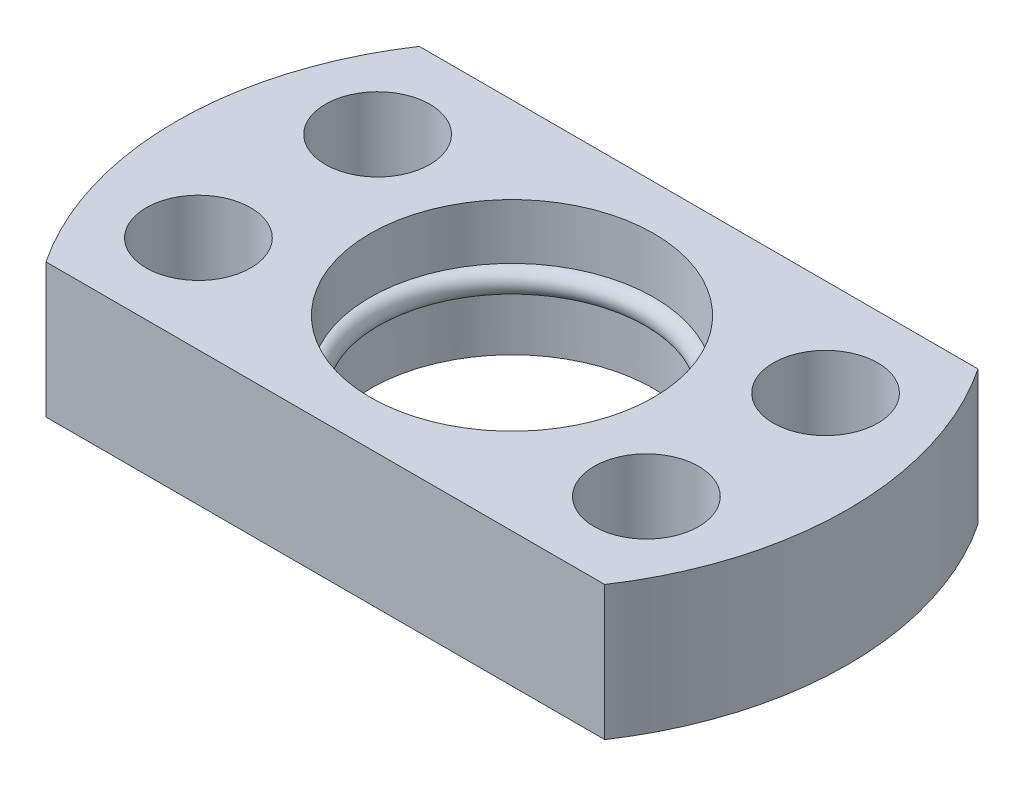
from build123d import *

# Parameters (mm, degrees)
SKETCH2_R           = 9.5
SKETCH2_R_2         = 3.5
BOSS_EXTRUDE1_DEPTH = 4.5
SKETCH3_R           = 0.8


with BuildPart() as part:
    # Sketch2 → Boss-Extrude1 (new, symmetric)
    with BuildSketch(Plane(origin=(0, 0, 0), x_dir=(1, 0, 0), z_dir=(0, 1, 0))):
        with BuildLine():
            Line((-18.708286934, 12.5), (18.708286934, 12.5))
            ThreePointArc((18.708286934, 12.5), (22.5, 0), (18.708286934, -12.5))
            Line((18.708286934, -12.5), (-18.708286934, -12.5))
            ThreePointArc((-18.708286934, -12.5), (-22.5, 0), (-18.708286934, 12.5))
        make_face()
        with Locations(Location((0, 0, 0), (0, 0, 270))):
            Circle(SKETCH2_R, mode=Mode.SUBTRACT)
        with Locations(Location((-15, 6, 0), (0, 0, 270))):
            Circle(SKETCH2_R_2, mode=Mode.SUBTRACT)
        with Locations(Location((15, 6, 0), (0, 0, 270))):
            Circle(SKETCH2_R_2, mode=Mode.SUBTRACT)
        with Locations(Location((-15, -6, 0), (0, 0, 270))):
            Circle(SKETCH2_R_2, mode=Mode.SUBTRACT)
        with Locations(Location((15, -6, 0), (0, 0, 270))):
            Circle(SKETCH2_R_2, mode=Mode.SUBTRACT)
    extrude(amount=BOSS_EXTRUDE1_DEPTH, both=True)

    # Sketch3 → Revolve1 (revolve)
    with BuildSketch(Plane.XY, mode=Mode.PRIVATE) as revolve1_sk:
        with Locations((-9.5, 0)):
            Circle(SKETCH3_R)
    revolve(revolve1_sk.sketch.rotate(Axis((0, 0, 0), (0, 1, 0)), 270), axis=Axis((0, 0, 0), (0, 1, 0)))


solid = part.part
